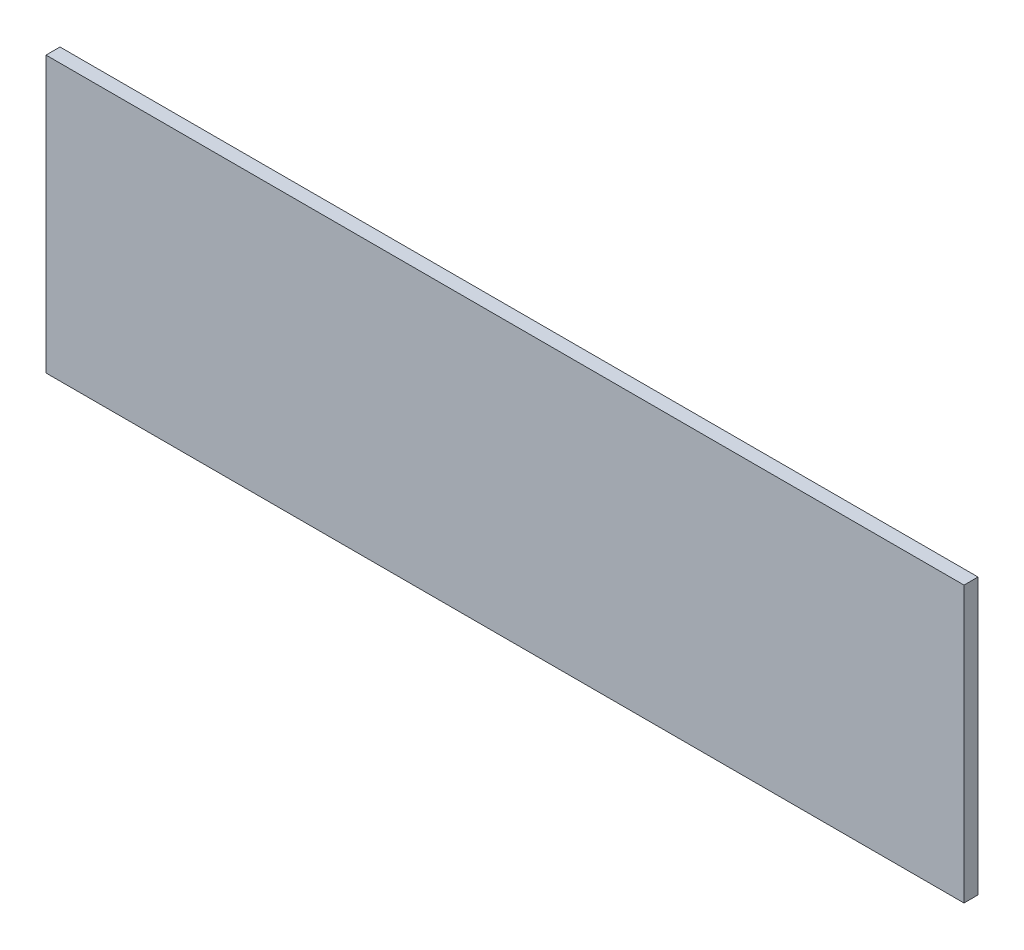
ISO-10303-21;
HEADER;
FILE_DESCRIPTION(('STEP AP214'),'2;1');
FILE_NAME('part.step','',(''),(''),'','','');
FILE_SCHEMA(('AUTOMOTIVE_DESIGN { 1 0 10303 214 1 1 1 1 }'));
ENDSEC;
DATA;
#1=APPLICATION_CONTEXT('core data for automotive mechanical design processes');
#2=APPLICATION_PROTOCOL_DEFINITION('international standard','automotive_design',2000,#1);
#3=PRODUCT_CONTEXT('',#1,'mechanical');
#4=PRODUCT('Part','Part','',(#3));
#5=PRODUCT_RELATED_PRODUCT_CATEGORY('part','',(#4));
#6=PRODUCT_DEFINITION_FORMATION('','',#4);
#7=PRODUCT_DEFINITION_CONTEXT('part definition',#1,'design');
#8=PRODUCT_DEFINITION('design','',#6,#7);
#9=PRODUCT_DEFINITION_SHAPE('','',#8);
#10=(LENGTH_UNIT() NAMED_UNIT(*) SI_UNIT(.MILLI.,.METRE.));
#11=(NAMED_UNIT(*) PLANE_ANGLE_UNIT() SI_UNIT($,.RADIAN.));
#12=(NAMED_UNIT(*) SI_UNIT($,.STERADIAN.) SOLID_ANGLE_UNIT());
#13=UNCERTAINTY_MEASURE_WITH_UNIT(LENGTH_MEASURE(1.E-05),#10,'distance_accuracy_value','');
#14=(GEOMETRIC_REPRESENTATION_CONTEXT(3) GLOBAL_UNCERTAINTY_ASSIGNED_CONTEXT((#13)) GLOBAL_UNIT_ASSIGNED_CONTEXT((#10,
#11,#12)) REPRESENTATION_CONTEXT('',''));
#15=CARTESIAN_POINT('',(0.,0.,0.));
#16=DIRECTION('',(0.,0.,1.));
#17=DIRECTION('',(1.,0.,0.));
#18=AXIS2_PLACEMENT_3D('',#15,#16,#17);
#19=CARTESIAN_POINT('',(16.8619995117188,13.7999499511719,-0.03048));
#20=DIRECTION('',(0.,-1.,0.));
#21=DIRECTION('',(0.,0.,-1.));
#22=AXIS2_PLACEMENT_3D('',#19,#20,#21);
#23=PLANE('',#22);
#24=DIRECTION('',(1.,0.,0.));
#25=VECTOR('',#24,1.);
#26=CARTESIAN_POINT('',(17.8619995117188,13.7999499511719,0.));
#27=LINE('',#26,#25);
#28=CARTESIAN_POINT('',(16.8619995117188,13.7999499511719,0.));
#29=VERTEX_POINT('',#28);
#30=CARTESIAN_POINT('',(18.8619995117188,13.7999499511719,0.));
#31=VERTEX_POINT('',#30);
#32=EDGE_CURVE('E69',#29,#31,#27,.T.);
#33=ORIENTED_EDGE('',*,*,#32,.T.);
#34=DIRECTION('',(0.,0.,-1.));
#35=VECTOR('',#34,1.);
#36=CARTESIAN_POINT('',(18.8619995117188,13.7999499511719,-0.01524));
#37=LINE('',#36,#35);
#38=CARTESIAN_POINT('',(18.8619995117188,13.7999499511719,-0.03048));
#39=VERTEX_POINT('',#38);
#40=EDGE_CURVE('E63',#31,#39,#37,.T.);
#41=ORIENTED_EDGE('',*,*,#40,.T.);
#42=DIRECTION('',(1.,0.,0.));
#43=VECTOR('',#42,1.);
#44=CARTESIAN_POINT('',(16.8619995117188,13.7999499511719,-0.03048));
#45=LINE('',#44,#43);
#46=CARTESIAN_POINT('',(16.8619995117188,13.7999499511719,-0.03048));
#47=VERTEX_POINT('',#46);
#48=EDGE_CURVE('E67',#47,#39,#45,.T.);
#49=ORIENTED_EDGE('',*,*,#48,.F.);
#50=DIRECTION('',(0.,0.,-1.));
#51=VECTOR('',#50,1.);
#52=CARTESIAN_POINT('',(16.8619995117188,13.7999499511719,-0.01524));
#53=LINE('',#52,#51);
#54=EDGE_CURVE('E11',#29,#47,#53,.T.);
#55=ORIENTED_EDGE('',*,*,#54,.F.);
#56=EDGE_LOOP('',(#33,#41,#49,#55));
#57=FACE_BOUND('',#56,.T.);
#58=ADVANCED_FACE('F17',(#57),#23,.F.);
#59=CARTESIAN_POINT('',(16.8619995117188,13.2000500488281,-0.03048));
#60=DIRECTION('',(1.,0.,0.));
#61=DIRECTION('',(0.,1.,0.));
#62=AXIS2_PLACEMENT_3D('',#59,#60,#61);
#63=PLANE('',#62);
#64=DIRECTION('',(0.,1.,0.));
#65=VECTOR('',#64,1.);
#66=CARTESIAN_POINT('',(16.8619995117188,13.5,0.));
#67=LINE('',#66,#65);
#68=CARTESIAN_POINT('',(16.8619995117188,13.2000500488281,0.));
#69=VERTEX_POINT('',#68);
#70=EDGE_CURVE('E97',#69,#29,#67,.T.);
#71=ORIENTED_EDGE('',*,*,#70,.T.);
#72=ORIENTED_EDGE('',*,*,#54,.T.);
#73=DIRECTION('',(0.,1.,0.));
#74=VECTOR('',#73,1.);
#75=CARTESIAN_POINT('',(16.8619995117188,13.2000500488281,-0.03048));
#76=LINE('',#75,#74);
#77=CARTESIAN_POINT('',(16.8619995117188,13.2000500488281,-0.03048));
#78=VERTEX_POINT('',#77);
#79=EDGE_CURVE('E84',#78,#47,#76,.T.);
#80=ORIENTED_EDGE('',*,*,#79,.F.);
#81=DIRECTION('',(0.,0.,-1.));
#82=VECTOR('',#81,1.);
#83=CARTESIAN_POINT('',(16.8619995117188,13.2000500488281,-0.01524));
#84=LINE('',#83,#82);
#85=EDGE_CURVE('E27',#69,#78,#84,.T.);
#86=ORIENTED_EDGE('',*,*,#85,.F.);
#87=EDGE_LOOP('',(#71,#72,#80,#86));
#88=FACE_BOUND('',#87,.T.);
#89=ADVANCED_FACE('F142',(#88),#63,.F.);
#90=CARTESIAN_POINT('',(18.8619995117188,13.2000500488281,-0.03048));
#91=DIRECTION('',(0.,1.,0.));
#92=DIRECTION('',(1.,0.,0.));
#93=AXIS2_PLACEMENT_3D('',#90,#91,#92);
#94=PLANE('',#93);
#95=DIRECTION('',(-1.,0.,0.));
#96=VECTOR('',#95,1.);
#97=CARTESIAN_POINT('',(17.8619995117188,13.2000500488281,0.));
#98=LINE('',#97,#96);
#99=CARTESIAN_POINT('',(18.8619995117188,13.2000500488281,0.));
#100=VERTEX_POINT('',#99);
#101=EDGE_CURVE('E92',#100,#69,#98,.T.);
#102=ORIENTED_EDGE('',*,*,#101,.T.);
#103=ORIENTED_EDGE('',*,*,#85,.T.);
#104=DIRECTION('',(-1.,0.,0.));
#105=VECTOR('',#104,1.);
#106=CARTESIAN_POINT('',(18.8619995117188,13.2000500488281,-0.03048));
#107=LINE('',#106,#105);
#108=CARTESIAN_POINT('',(18.8619995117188,13.2000500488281,-0.03048));
#109=VERTEX_POINT('',#108);
#110=EDGE_CURVE('E80',#109,#78,#107,.T.);
#111=ORIENTED_EDGE('',*,*,#110,.F.);
#112=DIRECTION('',(0.,0.,-1.));
#113=VECTOR('',#112,1.);
#114=CARTESIAN_POINT('',(18.8619995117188,13.2000500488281,-0.01524));
#115=LINE('',#114,#113);
#116=EDGE_CURVE('E20',#100,#109,#115,.T.);
#117=ORIENTED_EDGE('',*,*,#116,.F.);
#118=EDGE_LOOP('',(#102,#103,#111,#117));
#119=FACE_BOUND('',#118,.T.);
#120=ADVANCED_FACE('F134',(#119),#94,.F.);
#121=CARTESIAN_POINT('',(18.8619995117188,13.7999499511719,-0.03048));
#122=DIRECTION('',(-1.,0.,0.));
#123=DIRECTION('',(0.,0.,1.));
#124=AXIS2_PLACEMENT_3D('',#121,#122,#123);
#125=PLANE('',#124);
#126=DIRECTION('',(0.,-1.,0.));
#127=VECTOR('',#126,1.);
#128=CARTESIAN_POINT('',(18.8619995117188,13.5,0.));
#129=LINE('',#128,#127);
#130=EDGE_CURVE('E86',#31,#100,#129,.T.);
#131=ORIENTED_EDGE('',*,*,#130,.T.);
#132=ORIENTED_EDGE('',*,*,#116,.T.);
#133=DIRECTION('',(0.,-1.,0.));
#134=VECTOR('',#133,1.);
#135=CARTESIAN_POINT('',(18.8619995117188,13.7999499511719,-0.03048));
#136=LINE('',#135,#134);
#137=EDGE_CURVE('E75',#39,#109,#136,.T.);
#138=ORIENTED_EDGE('',*,*,#137,.F.);
#139=ORIENTED_EDGE('',*,*,#40,.F.);
#140=EDGE_LOOP('',(#131,#132,#138,#139));
#141=FACE_BOUND('',#140,.T.);
#142=ADVANCED_FACE('F76',(#141),#125,.F.);
#143=CARTESIAN_POINT('',(17.8619995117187,13.5,-0.03048));
#144=DIRECTION('',(0.,0.,1.));
#145=DIRECTION('',(1.,0.,0.));
#146=AXIS2_PLACEMENT_3D('',#143,#144,#145);
#147=PLANE('',#146);
#148=ORIENTED_EDGE('',*,*,#48,.T.);
#149=ORIENTED_EDGE('',*,*,#137,.T.);
#150=ORIENTED_EDGE('',*,*,#110,.T.);
#151=ORIENTED_EDGE('',*,*,#79,.T.);
#152=EDGE_LOOP('',(#148,#149,#150,#151));
#153=FACE_BOUND('',#152,.T.);
#154=ADVANCED_FACE('F83',(#153),#147,.F.);
#155=CARTESIAN_POINT('',(17.8619995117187,13.5,0.));
#156=DIRECTION('',(0.,0.,1.));
#157=DIRECTION('',(1.,0.,0.));
#158=AXIS2_PLACEMENT_3D('',#155,#156,#157);
#159=PLANE('',#158);
#160=ORIENTED_EDGE('',*,*,#32,.F.);
#161=ORIENTED_EDGE('',*,*,#70,.F.);
#162=ORIENTED_EDGE('',*,*,#101,.F.);
#163=ORIENTED_EDGE('',*,*,#130,.F.);
#164=EDGE_LOOP('',(#160,#161,#162,#163));
#165=FACE_BOUND('',#164,.T.);
#166=ADVANCED_FACE('F113',(#165),#159,.T.);
#167=CLOSED_SHELL('',(#58,#89,#120,#142,#154,#166));
#168=MANIFOLD_SOLID_BREP('B1',#167);
#169=ADVANCED_BREP_SHAPE_REPRESENTATION('',(#18,#168),#14);
#170=SHAPE_DEFINITION_REPRESENTATION(#9,#169);
ENDSEC;
END-ISO-10303-21;
